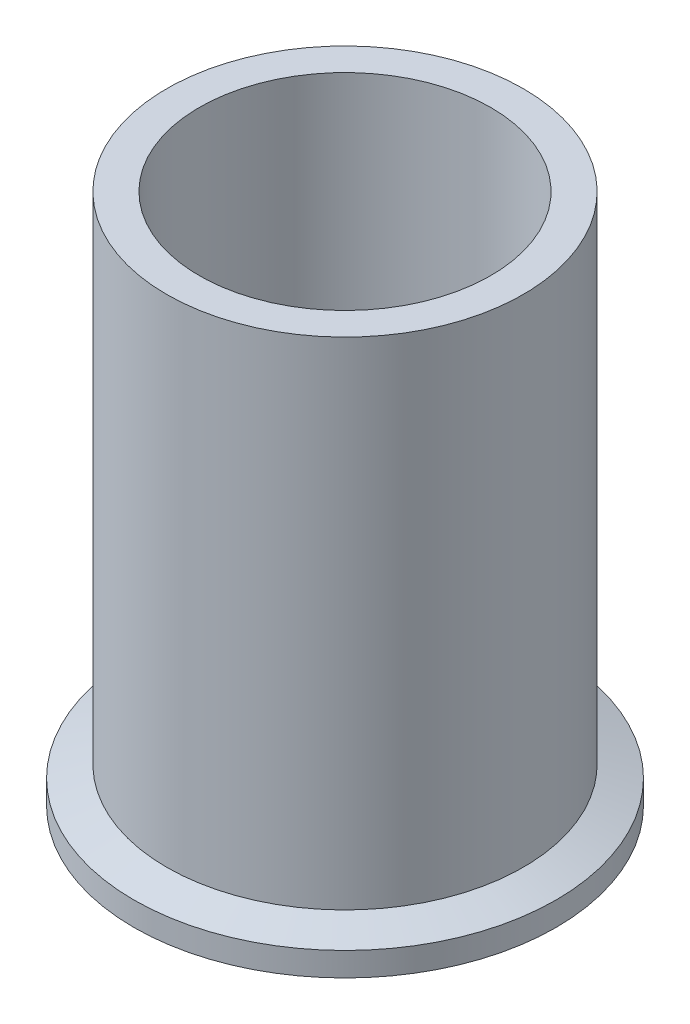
from build123d import *


with BuildPart() as part:
    # Sketch1 → Revolve2 (revolve)
    with BuildSketch(Plane.XY, mode=Mode.PRIVATE) as revolve2_sk:
        with BuildLine():
            Line((-17.399, 0), (-17.399, 63.5))
            Line((-17.399, 63.5), (-21.2852, 63.5))
            Line((-21.2852, 63.5), (-21.2852, 4.268505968))
            Line((-21.2852, 4.268505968), (-25.1968, 2.8448))
            Line((-25.1968, 2.8448), (-25.1968, 0))
            Line((-25.1968, 0), (-23.636608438, 0))
            ThreePointArc((-23.636608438, 0), (-23.204411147, 0.129217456), (-22.914066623, 0.474458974))
            ThreePointArc((-22.914066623, 0.474458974), (-21.8186, 1.1938), (-20.723133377, 0.474458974))
            ThreePointArc((-20.723133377, 0.474458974), (-20.432788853, 0.129217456), (-20.000591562, 0))
            Line((-20.000591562, 0), (-17.399, 0))
        make_face()
    revolve(revolve2_sk.sketch.rotate(Axis((0, 0, 0), (0, 1, 0)), 270), axis=Axis((0, 0, 0), (0, 1, 0)))


solid = part.part
